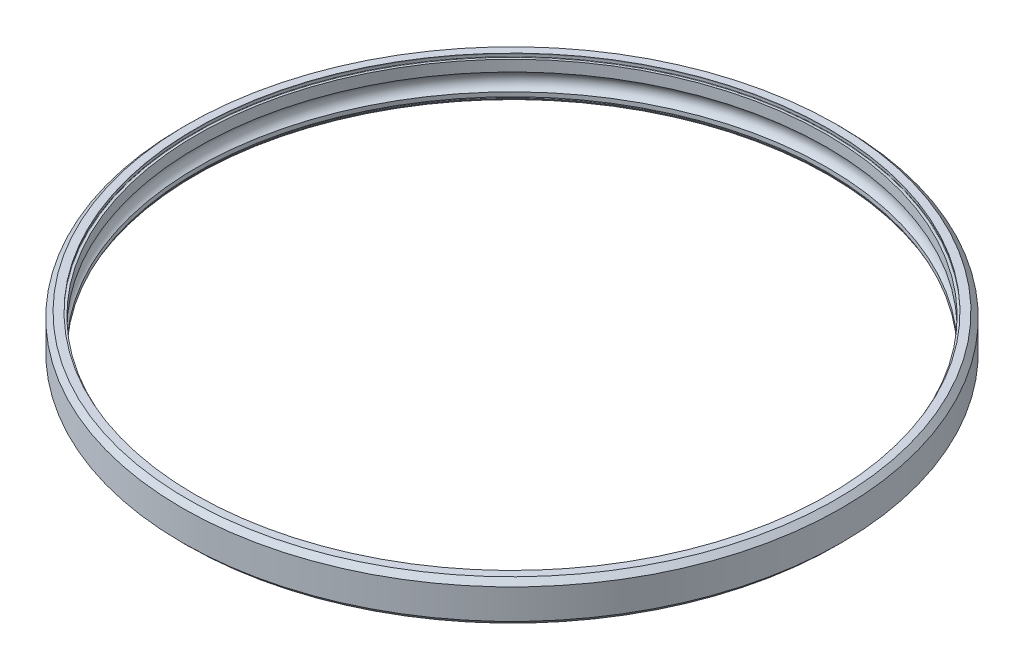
from build123d import *

# Parameters (mm, degrees)
SKETCH1_W        = 2.9464
SKETCH1_H        = 7.9375
O_D_CHAMFER_SIZE = 1.016


with BuildPart() as part:
    # Sketch1 → Base-Revolve (revolve)
    with BuildSketch(Plane.XY, mode=Mode.PRIVATE) as base_revolve_sk:
        with Locations((-63.6143, 0.67437)):
            Rectangle(SKETCH1_W, SKETCH1_H)
    revolve(base_revolve_sk.sketch.rotate(Axis((0, 0, 0), (0, 1, 0)), 270), axis=Axis((0, 0, 0), (0, 1, 0)))

    # Sketch of Path → Cut-Revolve Path (revolve, cut)
    with BuildSketch(Plane.XY, mode=Mode.PRIVATE) as cut_revolve_path_sk:
        with BuildLine():
            Line((-62.1411, 1.700007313), (-62.1411, -1.700007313))
            ThreePointArc((-62.1411, -1.700007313), (-63.10249, 0), (-62.1411, 1.700007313))
        make_face()
    revolve(cut_revolve_path_sk.sketch.rotate(Axis((0, 0, 0), (0, 1, 0)), 270), axis=Axis((0, 0, 0), (0, 1, 0)), mode=Mode.SUBTRACT)

    # O.D. Chamfer
    o_d_chamfer_edges = [part.edges().sort_by_distance(p)[0] for p in [
        (0, 4.64312, 65.0875),
        (0, -3.29438, 65.0875),
    ]]
    chamfer(o_d_chamfer_edges, length=O_D_CHAMFER_SIZE)

    # Sketch2 → Cut-Revolve Seal Groove (revolve, cut)
    with BuildSketch(Plane.XY, mode=Mode.PRIVATE) as cut_revolve_seal_groove_sk:
        with BuildLine():
            Line((-62.1411, 3.88112), (-62.5983, 3.88112))
            ThreePointArc((-62.5983, 3.88112), (-62.652181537, 3.903438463), (-62.6745, 3.95732))
            Line((-62.6745, 3.95732), (-62.6745, 4.43992))
            ThreePointArc((-62.6745, 4.43992), (-62.652181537, 4.493801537), (-62.5983, 4.51612))
            Line((-62.5983, 4.51612), (-62.54115, 4.51612))
            Line((-62.54115, 4.51612), (-62.54115, 4.64312))
            Line((-62.54115, 4.64312), (-62.1411, 4.64312))
            Line((-62.1411, 4.64312), (-62.1411, 3.88112))
        make_face()
    cut_revolve_seal_groove = revolve(cut_revolve_seal_groove_sk.sketch.rotate(Axis((0, 0, 0), (0, 1, 0)), 270), axis=Axis((0, 0, 0), (0, 1, 0)), mode=Mode.SUBTRACT)

    # Mirror Seal Groove: Cut-Revolve Seal Groove across plane
    add(cut_revolve_seal_groove.mirror(Plane.ZX.offset(0.67437)), mode=Mode.SUBTRACT)


solid = part.part
